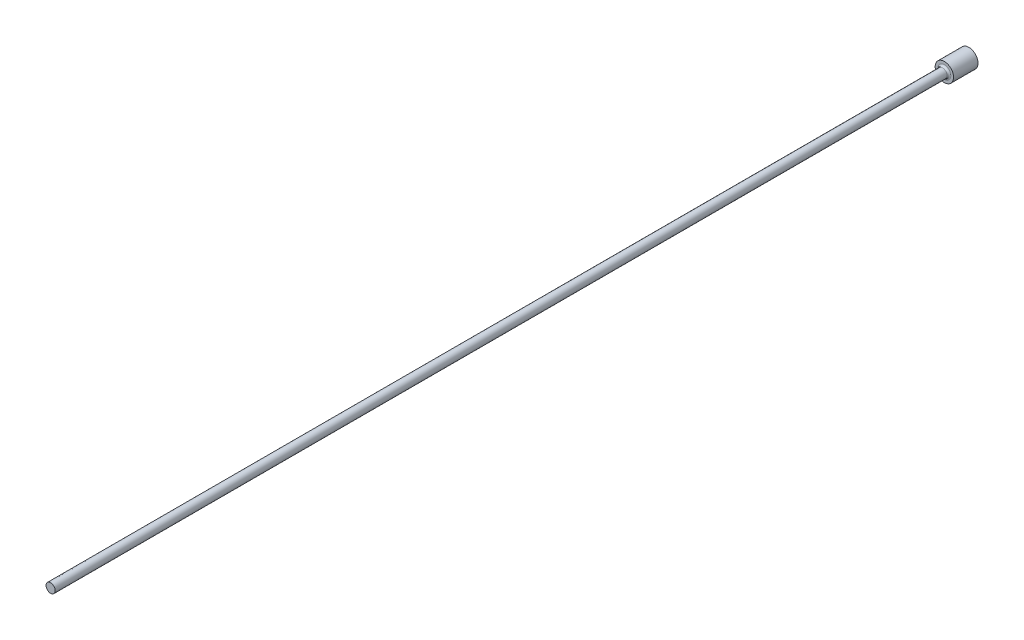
ISO-10303-21;
HEADER;
FILE_DESCRIPTION(('STEP AP214'),'2;1');
FILE_NAME('part.step','',(''),(''),'','','');
FILE_SCHEMA(('AUTOMOTIVE_DESIGN { 1 0 10303 214 1 1 1 1 }'));
ENDSEC;
DATA;
#1=APPLICATION_CONTEXT('core data for automotive mechanical design processes');
#2=APPLICATION_PROTOCOL_DEFINITION('international standard','automotive_design',2000,#1);
#3=PRODUCT_CONTEXT('',#1,'mechanical');
#4=PRODUCT('Part','Part','',(#3));
#5=PRODUCT_RELATED_PRODUCT_CATEGORY('part','',(#4));
#6=PRODUCT_DEFINITION_FORMATION('','',#4);
#7=PRODUCT_DEFINITION_CONTEXT('part definition',#1,'design');
#8=PRODUCT_DEFINITION('design','',#6,#7);
#9=PRODUCT_DEFINITION_SHAPE('','',#8);
#10=(LENGTH_UNIT() NAMED_UNIT(*) SI_UNIT(.MILLI.,.METRE.));
#11=(NAMED_UNIT(*) PLANE_ANGLE_UNIT() SI_UNIT($,.RADIAN.));
#12=(NAMED_UNIT(*) SI_UNIT($,.STERADIAN.) SOLID_ANGLE_UNIT());
#13=UNCERTAINTY_MEASURE_WITH_UNIT(LENGTH_MEASURE(1.E-05),#10,'distance_accuracy_value','');
#14=(GEOMETRIC_REPRESENTATION_CONTEXT(3) GLOBAL_UNCERTAINTY_ASSIGNED_CONTEXT((#13)) GLOBAL_UNIT_ASSIGNED_CONTEXT((#10,
#11,#12)) REPRESENTATION_CONTEXT('',''));
#15=CARTESIAN_POINT('',(0.,0.,0.));
#16=DIRECTION('',(0.,0.,1.));
#17=DIRECTION('',(1.,0.,0.));
#18=AXIS2_PLACEMENT_3D('',#15,#16,#17);
#19=CARTESIAN_POINT('',(1.5,0.,4.));
#20=DIRECTION('',(0.,0.,-1.));
#21=DIRECTION('',(-1.,0.,0.));
#22=AXIS2_PLACEMENT_3D('',#19,#20,#21);
#23=PLANE('',#22);
#24=CARTESIAN_POINT('',(0.,0.,4.));
#25=DIRECTION('',(0.,0.,-1.));
#26=DIRECTION('',(-1.,0.,0.));
#27=AXIS2_PLACEMENT_3D('',#24,#25,#26);
#28=CIRCLE('',#27,1.05000000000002);
#29=CARTESIAN_POINT('',(-1.05000000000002,0.,4.));
#30=VERTEX_POINT('',#29);
#31=EDGE_CURVE('E40',#30,#30,#28,.T.);
#32=ORIENTED_EDGE('',*,*,#31,.T.);
#33=EDGE_LOOP('',(#32));
#34=FACE_BOUND('',#33,.T.);
#35=CARTESIAN_POINT('',(0.,0.,4.));
#36=DIRECTION('',(0.,0.,-1.));
#37=DIRECTION('',(-1.,0.,0.));
#38=AXIS2_PLACEMENT_3D('',#35,#36,#37);
#39=CIRCLE('',#38,1.5);
#40=CARTESIAN_POINT('',(-1.5,0.,4.));
#41=VERTEX_POINT('',#40);
#42=EDGE_CURVE('E44',#41,#41,#39,.T.);
#43=ORIENTED_EDGE('',*,*,#42,.F.);
#44=EDGE_LOOP('',(#43));
#45=FACE_BOUND('',#44,.T.);
#46=ADVANCED_FACE('F33',(#34,#45),#23,.F.);
#47=CARTESIAN_POINT('',(0.,0.,-9.03322817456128));
#48=DIRECTION('',(0.,0.,-1.));
#49=DIRECTION('',(-1.,0.,0.));
#50=AXIS2_PLACEMENT_3D('',#47,#48,#49);
#51=CYLINDRICAL_SURFACE('',#50,1.5);
#52=CARTESIAN_POINT('',(0.,0.,0.));
#53=DIRECTION('',(0.,0.,-1.));
#54=DIRECTION('',(-1.,0.,0.));
#55=AXIS2_PLACEMENT_3D('',#52,#53,#54);
#56=CIRCLE('',#55,1.5);
#57=CARTESIAN_POINT('',(-1.5,0.,0.));
#58=VERTEX_POINT('',#57);
#59=EDGE_CURVE('E48',#58,#58,#56,.T.);
#60=ORIENTED_EDGE('',*,*,#59,.F.);
#61=EDGE_LOOP('',(#60));
#62=FACE_BOUND('',#61,.T.);
#63=ORIENTED_EDGE('',*,*,#42,.T.);
#64=EDGE_LOOP('',(#63));
#65=FACE_BOUND('',#64,.T.);
#66=ADVANCED_FACE('F68',(#62,#65),#51,.T.);
#67=CARTESIAN_POINT('',(0.,0.,0.));
#68=DIRECTION('',(0.,0.,1.));
#69=DIRECTION('',(1.,0.,0.));
#70=AXIS2_PLACEMENT_3D('',#67,#68,#69);
#71=PLANE('',#70);
#72=ORIENTED_EDGE('',*,*,#59,.T.);
#73=EDGE_LOOP('',(#72));
#74=FACE_BOUND('',#73,.T.);
#75=ADVANCED_FACE('F61',(#74),#71,.F.);
#76=CARTESIAN_POINT('',(0.,0.,150.));
#77=DIRECTION('',(0.,0.,-1.));
#78=DIRECTION('',(-1.,0.,0.));
#79=AXIS2_PLACEMENT_3D('',#76,#77,#78);
#80=PLANE('',#79);
#81=CARTESIAN_POINT('',(0.,0.,150.));
#82=DIRECTION('',(0.,0.,-1.));
#83=DIRECTION('',(-1.,0.,0.));
#84=AXIS2_PLACEMENT_3D('',#81,#82,#83);
#85=CIRCLE('',#84,0.75000000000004);
#86=CARTESIAN_POINT('',(-0.750000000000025,0.,150.));
#87=VERTEX_POINT('',#86);
#88=EDGE_CURVE('E53',#87,#87,#85,.T.);
#89=ORIENTED_EDGE('',*,*,#88,.F.);
#90=EDGE_LOOP('',(#89));
#91=FACE_BOUND('',#90,.T.);
#92=ADVANCED_FACE('F59',(#91),#80,.F.);
#93=CARTESIAN_POINT('',(0.,0.,-9.03322817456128));
#94=DIRECTION('',(0.,0.,-1.));
#95=DIRECTION('',(-1.,0.,0.));
#96=AXIS2_PLACEMENT_3D('',#93,#94,#95);
#97=CYLINDRICAL_SURFACE('',#96,0.75000000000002);
#98=CARTESIAN_POINT('',(0.,0.,4.3));
#99=DIRECTION('',(0.,0.,-1.));
#100=DIRECTION('',(-1.,0.,0.));
#101=AXIS2_PLACEMENT_3D('',#98,#99,#100);
#102=CIRCLE('',#101,0.75000000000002);
#103=CARTESIAN_POINT('',(-0.750000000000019,0.,4.3));
#104=VERTEX_POINT('',#103);
#105=EDGE_CURVE('E10',#104,#104,#102,.F.);
#106=ORIENTED_EDGE('',*,*,#105,.T.);
#107=EDGE_LOOP('',(#106));
#108=FACE_BOUND('',#107,.T.);
#109=ORIENTED_EDGE('',*,*,#88,.T.);
#110=EDGE_LOOP('',(#109));
#111=FACE_BOUND('',#110,.T.);
#112=ADVANCED_FACE('F57',(#108,#111),#97,.T.);
#113=CARTESIAN_POINT('',(0.,0.,4.3));
#114=DIRECTION('',(0.,0.,-1.));
#115=DIRECTION('',(-1.,0.,0.));
#116=AXIS2_PLACEMENT_3D('',#113,#114,#115);
#117=TOROIDAL_SURFACE('',#116,1.05000000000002,0.3);
#118=ORIENTED_EDGE('',*,*,#105,.F.);
#119=EDGE_LOOP('',(#118));
#120=FACE_BOUND('',#119,.T.);
#121=ORIENTED_EDGE('',*,*,#31,.F.);
#122=EDGE_LOOP('',(#121));
#123=FACE_BOUND('',#122,.T.);
#124=ADVANCED_FACE('F35',(#120,#123),#117,.F.);
#125=CLOSED_SHELL('',(#46,#66,#75,#92,#112,#124));
#126=MANIFOLD_SOLID_BREP('B2',#125);
#127=ADVANCED_BREP_SHAPE_REPRESENTATION('',(#18,#126),#14);
#128=SHAPE_DEFINITION_REPRESENTATION(#9,#127);
ENDSEC;
END-ISO-10303-21;
